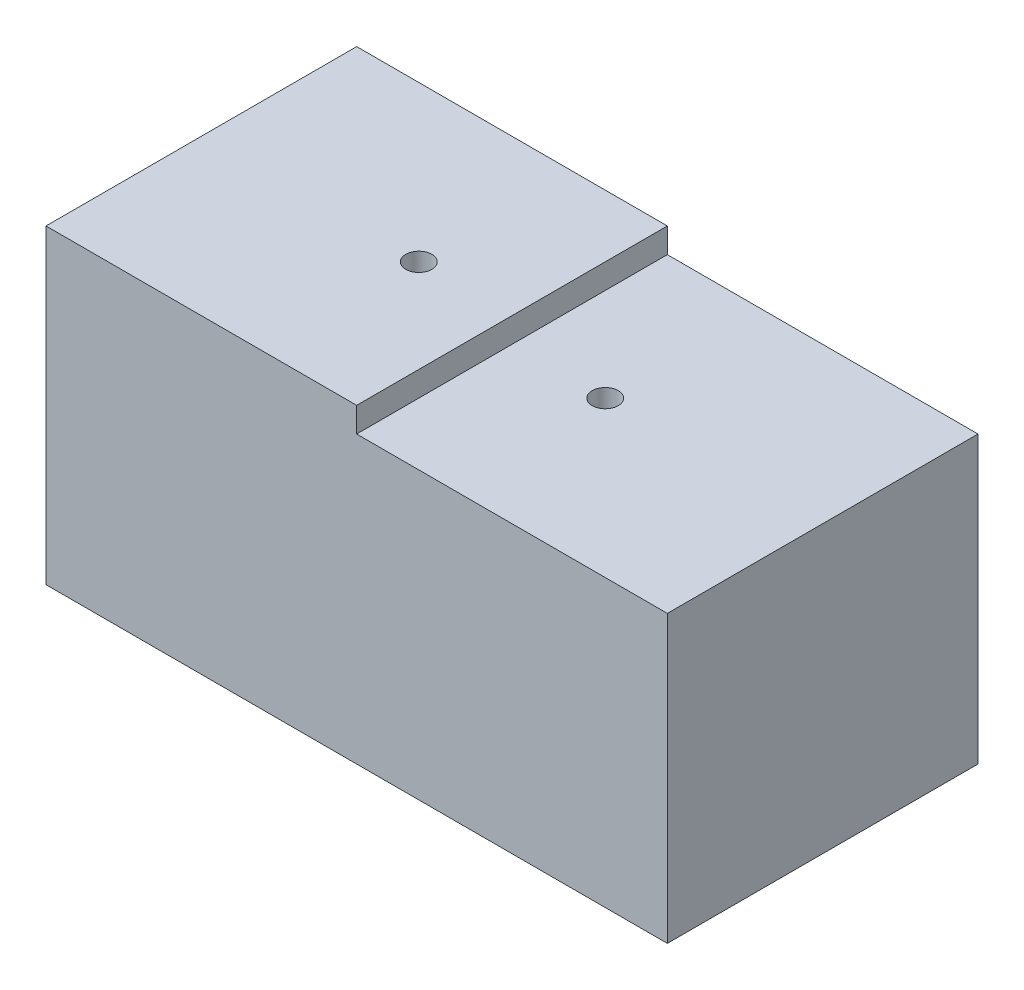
from build123d import *

# Parameters (mm, degrees)
SKETCH1_W          = 100
SKETCH1_H          = 50
EXTRUDE1_DEPTH     = 25
CUT_EXTRUDE1_REACH = 77
SKETCH2_W          = 50
SKETCH2_H          = 4
SKETCH3_R          = 2.1
CUT_EXTRUDE2_DEPTH = 20
LPATTERN1_COUNT    = 2
LPATTERN1_PITCH    = 30


with BuildPart() as part:
    # Sketch1 → Extrude1 (new, symmetric)
    with BuildSketch(Plane.XY):
        Rectangle(SKETCH1_W, SKETCH1_H)
    extrude(amount=EXTRUDE1_DEPTH, both=True)

    # Sketch2 → Cut-Extrude1 (cut, up to next)
    with BuildSketch(Plane.XY.offset(25), mode=Mode.PRIVATE) as cut_extrude1_sk1:
        with Locations((25, 23)):
            Rectangle(SKETCH2_W, SKETCH2_H)
    cut_extrude1_tool1 = extrude(cut_extrude1_sk1.sketch, amount=-CUT_EXTRUDE1_REACH, mode=Mode.PRIVATE) & part.part
    add(cut_extrude1_tool1.solids().sort_by_distance((25, 23, 25))[0], mode=Mode.SUBTRACT)

    # Sketch3 → Cut-Extrude2 (cut)
    with BuildSketch(Plane(origin=(0, 25, 0), x_dir=(-1, 0, 0), z_dir=(0, 1, 0))):
        with Locations((15, 0)):
            Circle(SKETCH3_R)
    cut_extrude2 = extrude(amount=-CUT_EXTRUDE2_DEPTH, mode=Mode.SUBTRACT)

    # Cut-Extrude3 cone 1 section (on through the dimple's axis) → Cut-Extrude3 (revolve, cut)
    with BuildSketch(Plane(origin=(-15, 5, 0), x_dir=(0, 0, 1), z_dir=(1, 0, 0))):
        Polygon((0, 0), (2.1, 0), (0, 1.2618073), align=None)
    cut_extrude3 = revolve(axis=Axis((-15, 5, 0), (0, -1, 0)), mode=Mode.SUBTRACT)

    # LPattern1: Cut-Extrude2, Cut-Extrude3 ×2
    with Locations(*[(i * LPATTERN1_PITCH, 0, 0) for i in range(1, LPATTERN1_COUNT)]):
        add(cut_extrude2, mode=Mode.SUBTRACT)
        add(cut_extrude3, mode=Mode.SUBTRACT)


solid = part.part
